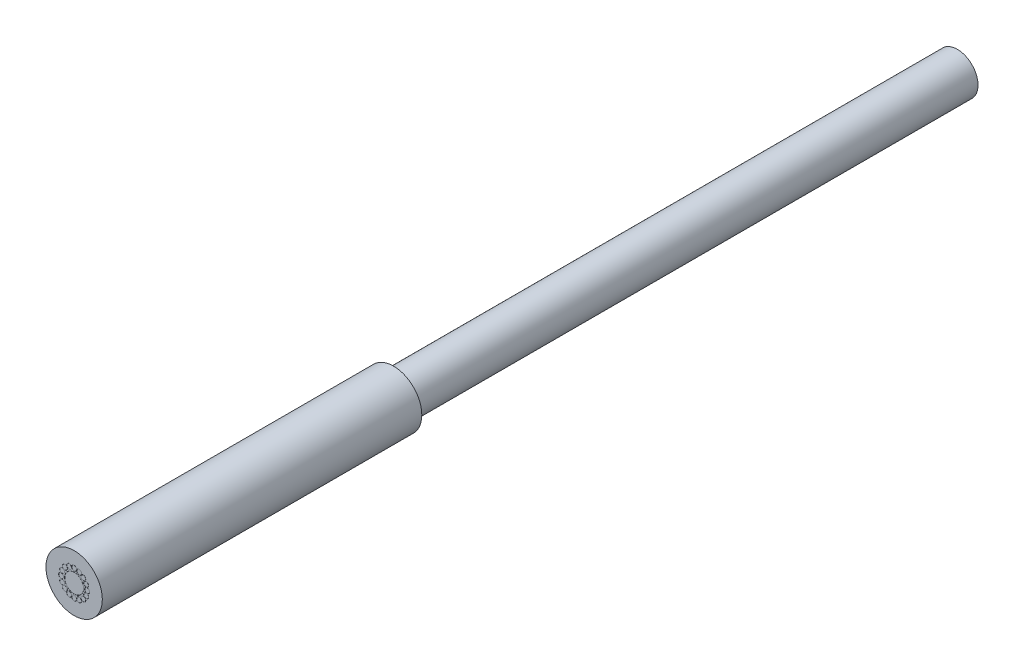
from build123d import *

# Parameters (mm, degrees)
SKETCH_1_R          = 1.5
EXTRUDE_1_DEPTH     = 17
SKETCH_2_R          = 1.1
EXTRUDE_2_DEPTH     = 30
SKETCH_3_R          = 0.505
SKETCH_3_R_2        = 0.5
SKETCH_3_R_3        = 0.13
SKETCH_3_R_4        = 0.125
CUT_EXTRUDE_1_DEPTH = 0.1


with BuildPart() as part:
    # Sketch 1 → Extrude 1 (new body)
    with BuildSketch(Plane.XY):
        Circle(SKETCH_1_R)
    extrude(amount=-EXTRUDE_1_DEPTH)

    # Sketch 2 → Extrude 2 (add)
    with BuildSketch(Plane(origin=(0, 0, -17), x_dir=(-1, 0, 0), z_dir=(0, 0, -1))):
        Circle(SKETCH_2_R)
    extrude(amount=EXTRUDE_2_DEPTH)

    # Sketch 3 → Cut-Extrude 1 (cut)
    # profile 1 of 17: a face of its own
    with BuildSketch(Plane.XY):
        Circle(SKETCH_3_R)
        Circle(SKETCH_3_R_2, mode=Mode.SUBTRACT)
    # profile 2 of 17: a face of its own
    with BuildSketch(Plane.XY):
        with Locations((0, 0.691987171)):
            Circle(SKETCH_3_R_3)
        with Locations((0, 0.691987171)):
            Circle(SKETCH_3_R_4, mode=Mode.SUBTRACT)
    # profile 3 of 17: a face of its own
    with BuildSketch(Plane.XY):
        with Locations((0.264812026, 0.639312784)):
            Circle(SKETCH_3_R_3)
        with Locations((0.264812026, 0.639312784)):
            Circle(SKETCH_3_R_4, mode=Mode.SUBTRACT)
    # profile 4 of 17: a face of its own
    with BuildSketch(Plane.XY):
        with Locations((0.489308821, 0.489308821)):
            Circle(SKETCH_3_R_3)
        with Locations((0.489308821, 0.489308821)):
            Circle(SKETCH_3_R_4, mode=Mode.SUBTRACT)
    # profile 5 of 17: a face of its own
    with BuildSketch(Plane.XY):
        with Locations((0.639312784, 0.264812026)):
            Circle(SKETCH_3_R_3)
        with Locations((0.639312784, 0.264812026)):
            Circle(SKETCH_3_R_4, mode=Mode.SUBTRACT)
    # profile 6 of 17: a face of its own
    with BuildSketch(Plane.XY):
        with Locations((0.691987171, 0)):
            Circle(SKETCH_3_R_3)
        with Locations((0.691987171, 0)):
            Circle(SKETCH_3_R_4, mode=Mode.SUBTRACT)
    # profile 7 of 17: a face of its own
    with BuildSketch(Plane.XY):
        with Locations((0.639312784, -0.264812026)):
            Circle(SKETCH_3_R_3)
        with Locations((0.639312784, -0.264812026)):
            Circle(SKETCH_3_R_4, mode=Mode.SUBTRACT)
    # profile 8 of 17: a face of its own
    with BuildSketch(Plane.XY):
        with Locations((0.489308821, -0.489308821)):
            Circle(SKETCH_3_R_3)
        with Locations((0.489308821, -0.489308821)):
            Circle(SKETCH_3_R_4, mode=Mode.SUBTRACT)
    # profile 9 of 17: a face of its own
    with BuildSketch(Plane.XY):
        with Locations((0.264812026, -0.639312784)):
            Circle(SKETCH_3_R_3)
        with Locations((0.264812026, -0.639312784)):
            Circle(SKETCH_3_R_4, mode=Mode.SUBTRACT)
    # profile 10 of 17: a face of its own
    with BuildSketch(Plane.XY):
        with Locations((0, -0.691987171)):
            Circle(SKETCH_3_R_3)
        with Locations((0, -0.691987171)):
            Circle(SKETCH_3_R_4, mode=Mode.SUBTRACT)
    # profile 11 of 17: a face of its own
    with BuildSketch(Plane.XY):
        with Locations((-0.264812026, -0.639312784)):
            Circle(SKETCH_3_R_3)
        with Locations((-0.264812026, -0.639312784)):
            Circle(SKETCH_3_R_4, mode=Mode.SUBTRACT)
    # profile 12 of 17: a face of its own
    with BuildSketch(Plane.XY):
        with Locations((-0.489308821, -0.489308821)):
            Circle(SKETCH_3_R_3)
        with Locations((-0.489308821, -0.489308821)):
            Circle(SKETCH_3_R_4, mode=Mode.SUBTRACT)
    # profile 13 of 17: a face of its own
    with BuildSketch(Plane.XY):
        with Locations((-0.639312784, -0.264812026)):
            Circle(SKETCH_3_R_3)
        with Locations((-0.639312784, -0.264812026)):
            Circle(SKETCH_3_R_4, mode=Mode.SUBTRACT)
    # profile 14 of 17: a face of its own
    with BuildSketch(Plane.XY):
        with Locations((-0.691987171, 0)):
            Circle(SKETCH_3_R_3)
        with Locations((-0.691987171, 0)):
            Circle(SKETCH_3_R_4, mode=Mode.SUBTRACT)
    # profile 15 of 17: a face of its own
    with BuildSketch(Plane.XY):
        with Locations((-0.639312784, 0.264812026)):
            Circle(SKETCH_3_R_3)
        with Locations((-0.639312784, 0.264812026)):
            Circle(SKETCH_3_R_4, mode=Mode.SUBTRACT)
    # profile 16 of 17: a face of its own
    with BuildSketch(Plane.XY):
        with Locations((-0.489308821, 0.489308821)):
            Circle(SKETCH_3_R_3)
        with Locations((-0.489308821, 0.489308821)):
            Circle(SKETCH_3_R_4, mode=Mode.SUBTRACT)
    # profile 17 of 17: a face of its own
    with BuildSketch(Plane.XY):
        with Locations((-0.264812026, 0.639312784)):
            Circle(SKETCH_3_R_3)
        with Locations((-0.264812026, 0.639312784)):
            Circle(SKETCH_3_R_4, mode=Mode.SUBTRACT)
    extrude(amount=-CUT_EXTRUDE_1_DEPTH, mode=Mode.SUBTRACT)


solid = part.part
